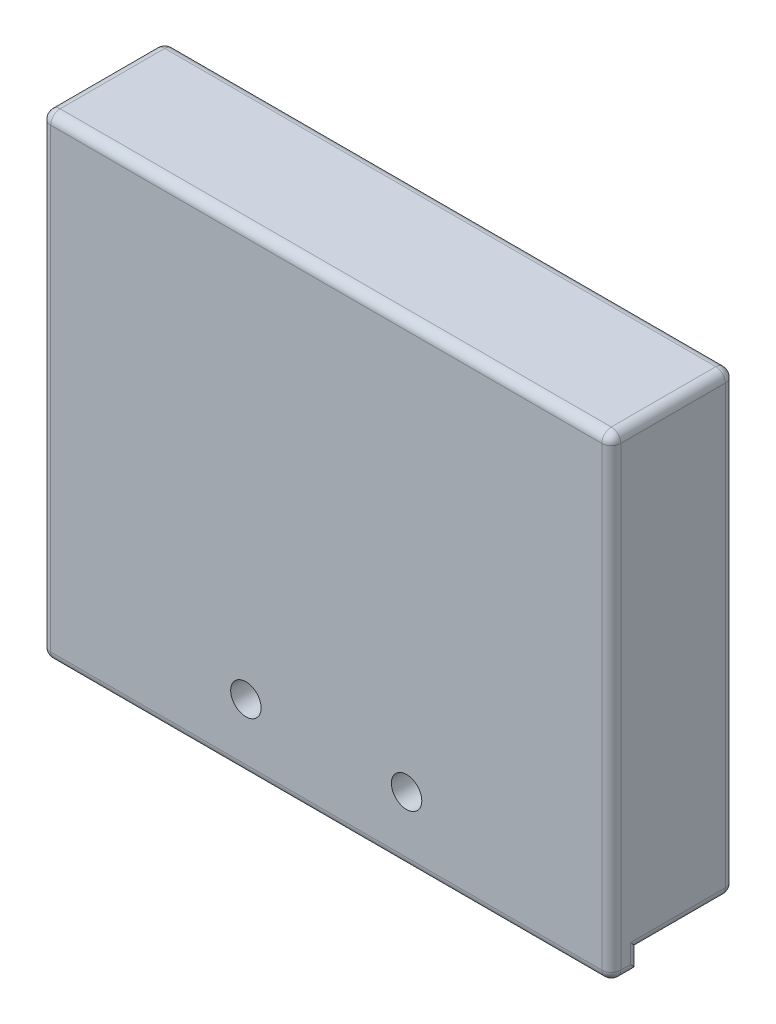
ISO-10303-21;
HEADER;
FILE_DESCRIPTION(('STEP AP214'),'2;1');
FILE_NAME('part.step','',(''),(''),'','','');
FILE_SCHEMA(('AUTOMOTIVE_DESIGN { 1 0 10303 214 1 1 1 1 }'));
ENDSEC;
DATA;
#1=APPLICATION_CONTEXT('core data for automotive mechanical design processes');
#2=APPLICATION_PROTOCOL_DEFINITION('international standard','automotive_design',2000,#1);
#3=PRODUCT_CONTEXT('',#1,'mechanical');
#4=PRODUCT('Part','Part','',(#3));
#5=PRODUCT_RELATED_PRODUCT_CATEGORY('part','',(#4));
#6=PRODUCT_DEFINITION_FORMATION('','',#4);
#7=PRODUCT_DEFINITION_CONTEXT('part definition',#1,'design');
#8=PRODUCT_DEFINITION('design','',#6,#7);
#9=PRODUCT_DEFINITION_SHAPE('','',#8);
#10=(LENGTH_UNIT() NAMED_UNIT(*) SI_UNIT(.MILLI.,.METRE.));
#11=(NAMED_UNIT(*) PLANE_ANGLE_UNIT() SI_UNIT($,.RADIAN.));
#12=(NAMED_UNIT(*) SI_UNIT($,.STERADIAN.) SOLID_ANGLE_UNIT());
#13=UNCERTAINTY_MEASURE_WITH_UNIT(LENGTH_MEASURE(1.E-05),#10,'distance_accuracy_value','');
#14=(GEOMETRIC_REPRESENTATION_CONTEXT(3) GLOBAL_UNCERTAINTY_ASSIGNED_CONTEXT((#13)) GLOBAL_UNIT_ASSIGNED_CONTEXT((#10,
#11,#12)) REPRESENTATION_CONTEXT('',''));
#15=CARTESIAN_POINT('',(0.,0.,0.));
#16=DIRECTION('',(0.,0.,1.));
#17=DIRECTION('',(1.,0.,0.));
#18=AXIS2_PLACEMENT_3D('',#15,#16,#17);
#19=CARTESIAN_POINT('',(0.,0.,3.));
#20=DIRECTION('',(0.,0.,-1.));
#21=DIRECTION('',(-1.,0.,0.));
#22=AXIS2_PLACEMENT_3D('',#19,#20,#21);
#23=PLANE('',#22);
#24=DIRECTION('',(-1.,0.,0.));
#25=VECTOR('',#24,1.);
#26=CARTESIAN_POINT('',(0.,24.,3.));
#27=LINE('',#26,#25);
#28=CARTESIAN_POINT('',(29.,24.,3.));
#29=VERTEX_POINT('',#28);
#30=CARTESIAN_POINT('',(-29.,24.,3.));
#31=VERTEX_POINT('',#30);
#32=EDGE_CURVE('E379',#29,#31,#27,.T.);
#33=ORIENTED_EDGE('',*,*,#32,.T.);
#34=DIRECTION('',(0.,-1.,0.));
#35=VECTOR('',#34,1.);
#36=CARTESIAN_POINT('',(-29.,0.,3.));
#37=LINE('',#36,#35);
#38=CARTESIAN_POINT('',(-29.,-24.,3.));
#39=VERTEX_POINT('',#38);
#40=EDGE_CURVE('E387',#31,#39,#37,.T.);
#41=ORIENTED_EDGE('',*,*,#40,.T.);
#42=DIRECTION('',(1.,0.,0.));
#43=VECTOR('',#42,1.);
#44=CARTESIAN_POINT('',(0.,-24.,3.));
#45=LINE('',#44,#43);
#46=CARTESIAN_POINT('',(29.,-24.,3.));
#47=VERTEX_POINT('',#46);
#48=EDGE_CURVE('E383',#39,#47,#45,.T.);
#49=ORIENTED_EDGE('',*,*,#48,.T.);
#50=DIRECTION('',(0.,1.,0.));
#51=VECTOR('',#50,1.);
#52=CARTESIAN_POINT('',(29.,0.,3.));
#53=LINE('',#52,#51);
#54=EDGE_CURVE('E375',#47,#29,#53,.T.);
#55=ORIENTED_EDGE('',*,*,#54,.T.);
#56=EDGE_LOOP('',(#33,#41,#49,#55));
#57=FACE_BOUND('',#56,.T.);
#58=CARTESIAN_POINT('',(-8.455,-18.04,3.));
#59=DIRECTION('',(0.,0.,1.));
#60=DIRECTION('',(1.,0.,0.));
#61=AXIS2_PLACEMENT_3D('',#58,#59,#60);
#62=CIRCLE('',#61,1.6);
#63=CARTESIAN_POINT('',(-6.855,-18.04,3.));
#64=VERTEX_POINT('',#63);
#65=EDGE_CURVE('E364',#64,#64,#62,.T.);
#66=ORIENTED_EDGE('',*,*,#65,.F.);
#67=EDGE_LOOP('',(#66));
#68=FACE_BOUND('',#67,.T.);
#69=CARTESIAN_POINT('',(8.455,-18.04,3.));
#70=DIRECTION('',(0.,0.,1.));
#71=DIRECTION('',(1.,0.,0.));
#72=AXIS2_PLACEMENT_3D('',#69,#70,#71);
#73=CIRCLE('',#72,1.6);
#74=CARTESIAN_POINT('',(10.055,-18.04,3.));
#75=VERTEX_POINT('',#74);
#76=EDGE_CURVE('E356',#75,#75,#73,.T.);
#77=ORIENTED_EDGE('',*,*,#76,.F.);
#78=EDGE_LOOP('',(#77));
#79=FACE_BOUND('',#78,.T.);
#80=ADVANCED_FACE('F47',(#57,#68,#79),#23,.F.);
#81=CARTESIAN_POINT('',(0.,0.,0.));
#82=DIRECTION('',(0.,0.,-1.));
#83=DIRECTION('',(-1.,0.,0.));
#84=AXIS2_PLACEMENT_3D('',#81,#82,#83);
#85=PLANE('',#84);
#86=DIRECTION('',(1.,0.,0.));
#87=VECTOR('',#86,1.);
#88=CARTESIAN_POINT('',(-30.,-25.,0.));
#89=LINE('',#88,#87);
#90=CARTESIAN_POINT('',(-29.,-25.,0.));
#91=VERTEX_POINT('',#90);
#92=CARTESIAN_POINT('',(29.,-25.,0.));
#93=VERTEX_POINT('',#92);
#94=EDGE_CURVE('E368',#91,#93,#89,.T.);
#95=ORIENTED_EDGE('',*,*,#94,.F.);
#96=DIRECTION('',(0.,-1.,0.));
#97=VECTOR('',#96,1.);
#98=CARTESIAN_POINT('',(-29.,-23.,0.));
#99=LINE('',#98,#97);
#100=CARTESIAN_POINT('',(-29.,-23.,0.));
#101=VERTEX_POINT('',#100);
#102=EDGE_CURVE('E469',#91,#101,#99,.F.);
#103=ORIENTED_EDGE('',*,*,#102,.T.);
#104=DIRECTION('',(-1.,0.,0.));
#105=VECTOR('',#104,1.);
#106=CARTESIAN_POINT('',(-28.,-23.,0.));
#107=LINE('',#106,#105);
#108=CARTESIAN_POINT('',(-28.,-23.,0.));
#109=VERTEX_POINT('',#108);
#110=EDGE_CURVE('E339',#109,#101,#107,.T.);
#111=ORIENTED_EDGE('',*,*,#110,.F.);
#112=DIRECTION('',(0.,-1.,0.));
#113=VECTOR('',#112,1.);
#114=CARTESIAN_POINT('',(-28.,-23.,0.));
#115=LINE('',#114,#113);
#116=CARTESIAN_POINT('',(-28.,23.,0.));
#117=VERTEX_POINT('',#116);
#118=EDGE_CURVE('E335',#117,#109,#115,.T.);
#119=ORIENTED_EDGE('',*,*,#118,.F.);
#120=DIRECTION('',(-1.,0.,0.));
#121=VECTOR('',#120,1.);
#122=CARTESIAN_POINT('',(-28.,23.,0.));
#123=LINE('',#122,#121);
#124=CARTESIAN_POINT('',(28.,23.,0.));
#125=VERTEX_POINT('',#124);
#126=EDGE_CURVE('E329',#125,#117,#123,.T.);
#127=ORIENTED_EDGE('',*,*,#126,.F.);
#128=DIRECTION('',(0.,1.,0.));
#129=VECTOR('',#128,1.);
#130=CARTESIAN_POINT('',(28.,23.,0.));
#131=LINE('',#130,#129);
#132=CARTESIAN_POINT('',(28.,-23.,0.));
#133=VERTEX_POINT('',#132);
#134=EDGE_CURVE('E325',#133,#125,#131,.T.);
#135=ORIENTED_EDGE('',*,*,#134,.F.);
#136=DIRECTION('',(-1.,0.,0.));
#137=VECTOR('',#136,1.);
#138=CARTESIAN_POINT('',(28.,-23.,0.));
#139=LINE('',#138,#137);
#140=CARTESIAN_POINT('',(29.,-23.,0.));
#141=VERTEX_POINT('',#140);
#142=EDGE_CURVE('E98',#141,#133,#139,.T.);
#143=ORIENTED_EDGE('',*,*,#142,.F.);
#144=DIRECTION('',(0.,1.,0.));
#145=VECTOR('',#144,1.);
#146=CARTESIAN_POINT('',(29.,-25.,0.));
#147=LINE('',#146,#145);
#148=EDGE_CURVE('E466',#141,#93,#147,.F.);
#149=ORIENTED_EDGE('',*,*,#148,.T.);
#150=EDGE_LOOP('',(#95,#103,#111,#119,#127,#135,#143,#149));
#151=FACE_BOUND('',#150,.T.);
#152=CARTESIAN_POINT('',(-8.455,-18.04,0.));
#153=DIRECTION('',(0.,0.,1.));
#154=DIRECTION('',(1.,0.,0.));
#155=AXIS2_PLACEMENT_3D('',#152,#153,#154);
#156=CIRCLE('',#155,1.6);
#157=CARTESIAN_POINT('',(-6.855,-18.04,0.));
#158=VERTEX_POINT('',#157);
#159=EDGE_CURVE('E360',#158,#158,#156,.T.);
#160=ORIENTED_EDGE('',*,*,#159,.T.);
#161=EDGE_LOOP('',(#160));
#162=FACE_BOUND('',#161,.T.);
#163=CARTESIAN_POINT('',(8.455,-18.04,0.));
#164=DIRECTION('',(0.,0.,1.));
#165=DIRECTION('',(1.,0.,0.));
#166=AXIS2_PLACEMENT_3D('',#163,#164,#165);
#167=CIRCLE('',#166,1.6);
#168=CARTESIAN_POINT('',(10.055,-18.04,0.));
#169=VERTEX_POINT('',#168);
#170=EDGE_CURVE('E355',#169,#169,#167,.T.);
#171=ORIENTED_EDGE('',*,*,#170,.T.);
#172=EDGE_LOOP('',(#171));
#173=FACE_BOUND('',#172,.T.);
#174=ADVANCED_FACE('F532',(#151,#162,#173),#85,.T.);
#175=CARTESIAN_POINT('',(30.,-25.,3.));
#176=DIRECTION('',(-1.,0.,0.));
#177=DIRECTION('',(0.,0.,1.));
#178=AXIS2_PLACEMENT_3D('',#175,#176,#177);
#179=PLANE('',#178);
#180=DIRECTION('',(0.,1.,0.));
#181=VECTOR('',#180,1.);
#182=CARTESIAN_POINT('',(30.,-25.,2.));
#183=LINE('',#182,#181);
#184=CARTESIAN_POINT('',(30.,24.,2.));
#185=VERTEX_POINT('',#184);
#186=CARTESIAN_POINT('',(30.,-24.,2.));
#187=VERTEX_POINT('',#186);
#188=EDGE_CURVE('E403',#185,#187,#183,.F.);
#189=ORIENTED_EDGE('',*,*,#188,.T.);
#190=DIRECTION('',(0.,0.,-1.));
#191=VECTOR('',#190,1.);
#192=CARTESIAN_POINT('',(30.,-24.,3.));
#193=LINE('',#192,#191);
#194=CARTESIAN_POINT('',(30.,-24.,1.));
#195=VERTEX_POINT('',#194);
#196=EDGE_CURVE('E11',#187,#195,#193,.T.);
#197=ORIENTED_EDGE('',*,*,#196,.T.);
#198=DIRECTION('',(0.,1.,0.));
#199=VECTOR('',#198,1.);
#200=CARTESIAN_POINT('',(30.,-23.,1.));
#201=LINE('',#200,#199);
#202=CARTESIAN_POINT('',(30.,-22.,1.));
#203=VERTEX_POINT('',#202);
#204=EDGE_CURVE('E58',#195,#203,#201,.T.);
#205=ORIENTED_EDGE('',*,*,#204,.T.);
#206=DIRECTION('',(0.,0.,1.));
#207=VECTOR('',#206,1.);
#208=CARTESIAN_POINT('',(30.,-22.,3.));
#209=LINE('',#208,#207);
#210=CARTESIAN_POINT('',(30.,-22.,-9.));
#211=VERTEX_POINT('',#210);
#212=EDGE_CURVE('E196',#203,#211,#209,.F.);
#213=ORIENTED_EDGE('',*,*,#212,.T.);
#214=DIRECTION('',(0.,-1.,0.));
#215=VECTOR('',#214,1.);
#216=CARTESIAN_POINT('',(30.,25.,-9.));
#217=LINE('',#216,#215);
#218=CARTESIAN_POINT('',(30.,24.,-9.));
#219=VERTEX_POINT('',#218);
#220=EDGE_CURVE('E200',#211,#219,#217,.F.);
#221=ORIENTED_EDGE('',*,*,#220,.T.);
#222=DIRECTION('',(0.,0.,-1.));
#223=VECTOR('',#222,1.);
#224=CARTESIAN_POINT('',(30.,24.,3.));
#225=LINE('',#224,#223);
#226=EDGE_CURVE('E225',#219,#185,#225,.F.);
#227=ORIENTED_EDGE('',*,*,#226,.T.);
#228=EDGE_LOOP('',(#189,#197,#205,#213,#221,#227));
#229=FACE_BOUND('',#228,.T.);
#230=ADVANCED_FACE('F198',(#229),#179,.F.);
#231=CARTESIAN_POINT('',(-30.,25.,3.));
#232=DIRECTION('',(0.,-1.,0.));
#233=DIRECTION('',(0.,0.,-1.));
#234=AXIS2_PLACEMENT_3D('',#231,#232,#233);
#235=PLANE('',#234);
#236=DIRECTION('',(1.,0.,0.));
#237=VECTOR('',#236,1.);
#238=CARTESIAN_POINT('',(-30.,25.,-9.));
#239=LINE('',#238,#237);
#240=CARTESIAN_POINT('',(29.,25.,-9.));
#241=VERTEX_POINT('',#240);
#242=CARTESIAN_POINT('',(-29.,25.,-9.));
#243=VERTEX_POINT('',#242);
#244=EDGE_CURVE('E481',#241,#243,#239,.F.);
#245=ORIENTED_EDGE('',*,*,#244,.T.);
#246=DIRECTION('',(0.,0.,-1.));
#247=VECTOR('',#246,1.);
#248=CARTESIAN_POINT('',(-29.,25.,3.));
#249=LINE('',#248,#247);
#250=CARTESIAN_POINT('',(-29.,25.,2.));
#251=VERTEX_POINT('',#250);
#252=EDGE_CURVE('E228',#243,#251,#249,.F.);
#253=ORIENTED_EDGE('',*,*,#252,.T.);
#254=DIRECTION('',(-1.,0.,0.));
#255=VECTOR('',#254,1.);
#256=CARTESIAN_POINT('',(-30.,25.,2.));
#257=LINE('',#256,#255);
#258=CARTESIAN_POINT('',(29.,25.,2.));
#259=VERTEX_POINT('',#258);
#260=EDGE_CURVE('E399',#251,#259,#257,.F.);
#261=ORIENTED_EDGE('',*,*,#260,.T.);
#262=DIRECTION('',(0.,0.,-1.));
#263=VECTOR('',#262,1.);
#264=CARTESIAN_POINT('',(29.,25.,3.));
#265=LINE('',#264,#263);
#266=EDGE_CURVE('E478',#259,#241,#265,.T.);
#267=ORIENTED_EDGE('',*,*,#266,.T.);
#268=EDGE_LOOP('',(#245,#253,#261,#267));
#269=FACE_BOUND('',#268,.T.);
#270=ADVANCED_FACE('F487',(#269),#235,.F.);
#271=CARTESIAN_POINT('',(-30.,-25.,3.));
#272=DIRECTION('',(1.,0.,0.));
#273=DIRECTION('',(0.,0.,-1.));
#274=AXIS2_PLACEMENT_3D('',#271,#272,#273);
#275=PLANE('',#274);
#276=DIRECTION('',(0.,-1.,0.));
#277=VECTOR('',#276,1.);
#278=CARTESIAN_POINT('',(-30.,-25.,1.));
#279=LINE('',#278,#277);
#280=CARTESIAN_POINT('',(-30.,-22.,1.));
#281=VERTEX_POINT('',#280);
#282=CARTESIAN_POINT('',(-30.,-24.,1.));
#283=VERTEX_POINT('',#282);
#284=EDGE_CURVE('E460',#281,#283,#279,.T.);
#285=ORIENTED_EDGE('',*,*,#284,.T.);
#286=DIRECTION('',(0.,0.,-1.));
#287=VECTOR('',#286,1.);
#288=CARTESIAN_POINT('',(-30.,-24.,3.));
#289=LINE('',#288,#287);
#290=CARTESIAN_POINT('',(-30.,-24.,2.));
#291=VERTEX_POINT('',#290);
#292=EDGE_CURVE('E463',#283,#291,#289,.F.);
#293=ORIENTED_EDGE('',*,*,#292,.T.);
#294=DIRECTION('',(0.,-1.,0.));
#295=VECTOR('',#294,1.);
#296=CARTESIAN_POINT('',(-30.,-25.,2.));
#297=LINE('',#296,#295);
#298=CARTESIAN_POINT('',(-30.,24.,2.));
#299=VERTEX_POINT('',#298);
#300=EDGE_CURVE('E391',#291,#299,#297,.F.);
#301=ORIENTED_EDGE('',*,*,#300,.T.);
#302=DIRECTION('',(0.,0.,-1.));
#303=VECTOR('',#302,1.);
#304=CARTESIAN_POINT('',(-30.,24.,3.));
#305=LINE('',#304,#303);
#306=CARTESIAN_POINT('',(-30.,24.,-9.));
#307=VERTEX_POINT('',#306);
#308=EDGE_CURVE('E451',#299,#307,#305,.T.);
#309=ORIENTED_EDGE('',*,*,#308,.T.);
#310=DIRECTION('',(0.,1.,0.));
#311=VECTOR('',#310,1.);
#312=CARTESIAN_POINT('',(-30.,-23.,-9.));
#313=LINE('',#312,#311);
#314=CARTESIAN_POINT('',(-30.,-22.,-9.));
#315=VERTEX_POINT('',#314);
#316=EDGE_CURVE('E454',#307,#315,#313,.F.);
#317=ORIENTED_EDGE('',*,*,#316,.T.);
#318=DIRECTION('',(0.,0.,1.));
#319=VECTOR('',#318,1.);
#320=CARTESIAN_POINT('',(-30.,-22.,3.));
#321=LINE('',#320,#319);
#322=EDGE_CURVE('E457',#315,#281,#321,.T.);
#323=ORIENTED_EDGE('',*,*,#322,.T.);
#324=EDGE_LOOP('',(#285,#293,#301,#309,#317,#323));
#325=FACE_BOUND('',#324,.T.);
#326=ADVANCED_FACE('F506',(#325),#275,.F.);
#327=CARTESIAN_POINT('',(-30.,-25.,3.));
#328=DIRECTION('',(0.,1.,0.));
#329=DIRECTION('',(0.,0.,1.));
#330=AXIS2_PLACEMENT_3D('',#327,#328,#329);
#331=PLANE('',#330);
#332=DIRECTION('',(1.,0.,0.));
#333=VECTOR('',#332,1.);
#334=CARTESIAN_POINT('',(-30.,-25.,2.));
#335=LINE('',#334,#333);
#336=CARTESIAN_POINT('',(29.,-25.,2.));
#337=VERTEX_POINT('',#336);
#338=CARTESIAN_POINT('',(-29.,-25.,2.));
#339=VERTEX_POINT('',#338);
#340=EDGE_CURVE('E395',#337,#339,#335,.F.);
#341=ORIENTED_EDGE('',*,*,#340,.T.);
#342=DIRECTION('',(0.,0.,-1.));
#343=VECTOR('',#342,1.);
#344=CARTESIAN_POINT('',(-29.,-25.,3.));
#345=LINE('',#344,#343);
#346=EDGE_CURVE('E475',#339,#91,#345,.T.);
#347=ORIENTED_EDGE('',*,*,#346,.T.);
#348=ORIENTED_EDGE('',*,*,#94,.T.);
#349=DIRECTION('',(0.,0.,-1.));
#350=VECTOR('',#349,1.);
#351=CARTESIAN_POINT('',(29.,-25.,3.));
#352=LINE('',#351,#350);
#353=EDGE_CURVE('E472',#93,#337,#352,.F.);
#354=ORIENTED_EDGE('',*,*,#353,.T.);
#355=EDGE_LOOP('',(#341,#347,#348,#354));
#356=FACE_BOUND('',#355,.T.);
#357=ADVANCED_FACE('F527',(#356),#331,.F.);
#358=CARTESIAN_POINT('',(-8.455,-18.04,3.));
#359=DIRECTION('',(0.,0.,-1.));
#360=DIRECTION('',(-1.,0.,0.));
#361=AXIS2_PLACEMENT_3D('',#358,#359,#360);
#362=CYLINDRICAL_SURFACE('',#361,1.6);
#363=ORIENTED_EDGE('',*,*,#65,.T.);
#364=EDGE_LOOP('',(#363));
#365=FACE_BOUND('',#364,.T.);
#366=ORIENTED_EDGE('',*,*,#159,.F.);
#367=EDGE_LOOP('',(#366));
#368=FACE_BOUND('',#367,.T.);
#369=ADVANCED_FACE('F589',(#365,#368),#362,.F.);
#370=CARTESIAN_POINT('',(8.455,-18.04,3.));
#371=DIRECTION('',(0.,0.,-1.));
#372=DIRECTION('',(-1.,0.,0.));
#373=AXIS2_PLACEMENT_3D('',#370,#371,#372);
#374=CYLINDRICAL_SURFACE('',#373,1.6);
#375=ORIENTED_EDGE('',*,*,#76,.T.);
#376=EDGE_LOOP('',(#375));
#377=FACE_BOUND('',#376,.T.);
#378=ORIENTED_EDGE('',*,*,#170,.F.);
#379=EDGE_LOOP('',(#378));
#380=FACE_BOUND('',#379,.T.);
#381=ADVANCED_FACE('F866',(#377,#380),#374,.F.);
#382=CARTESIAN_POINT('',(28.,-23.,-10.));
#383=DIRECTION('',(0.,1.,0.));
#384=DIRECTION('',(0.,0.,1.));
#385=AXIS2_PLACEMENT_3D('',#382,#383,#384);
#386=PLANE('',#385);
#387=DIRECTION('',(0.,0.,1.));
#388=VECTOR('',#387,1.);
#389=CARTESIAN_POINT('',(28.,-23.,-10.));
#390=LINE('',#389,#388);
#391=CARTESIAN_POINT('',(28.,-23.,-9.));
#392=VERTEX_POINT('',#391);
#393=EDGE_CURVE('E352',#392,#133,#390,.T.);
#394=ORIENTED_EDGE('',*,*,#393,.F.);
#395=DIRECTION('',(-1.,0.,0.));
#396=VECTOR('',#395,1.);
#397=CARTESIAN_POINT('',(30.,-23.,-9.));
#398=LINE('',#397,#396);
#399=CARTESIAN_POINT('',(29.,-23.,-9.));
#400=VERTEX_POINT('',#399);
#401=EDGE_CURVE('E448',#392,#400,#398,.F.);
#402=ORIENTED_EDGE('',*,*,#401,.T.);
#403=DIRECTION('',(0.,0.,1.));
#404=VECTOR('',#403,1.);
#405=CARTESIAN_POINT('',(29.,-23.,-10.));
#406=LINE('',#405,#404);
#407=EDGE_CURVE('E211',#400,#141,#406,.T.);
#408=ORIENTED_EDGE('',*,*,#407,.T.);
#409=ORIENTED_EDGE('',*,*,#142,.T.);
#410=EDGE_LOOP('',(#394,#402,#408,#409));
#411=FACE_BOUND('',#410,.T.);
#412=ADVANCED_FACE('F543',(#411),#386,.F.);
#413=CARTESIAN_POINT('',(28.,23.,-10.));
#414=DIRECTION('',(1.,0.,0.));
#415=DIRECTION('',(0.,1.,0.));
#416=AXIS2_PLACEMENT_3D('',#413,#414,#415);
#417=PLANE('',#416);
#418=DIRECTION('',(0.,0.,1.));
#419=VECTOR('',#418,1.);
#420=CARTESIAN_POINT('',(28.,23.,-10.));
#421=LINE('',#420,#419);
#422=CARTESIAN_POINT('',(28.,23.,-9.));
#423=VERTEX_POINT('',#422);
#424=EDGE_CURVE('E349',#423,#125,#421,.T.);
#425=ORIENTED_EDGE('',*,*,#424,.F.);
#426=DIRECTION('',(0.,1.,0.));
#427=VECTOR('',#426,1.);
#428=CARTESIAN_POINT('',(28.,-23.,-9.));
#429=LINE('',#428,#427);
#430=EDGE_CURVE('E443',#423,#392,#429,.F.);
#431=ORIENTED_EDGE('',*,*,#430,.T.);
#432=ORIENTED_EDGE('',*,*,#393,.T.);
#433=ORIENTED_EDGE('',*,*,#134,.T.);
#434=EDGE_LOOP('',(#425,#431,#432,#433));
#435=FACE_BOUND('',#434,.T.);
#436=ADVANCED_FACE('F540',(#435),#417,.F.);
#437=CARTESIAN_POINT('',(-28.,23.,-10.));
#438=DIRECTION('',(0.,1.,0.));
#439=DIRECTION('',(0.,0.,1.));
#440=AXIS2_PLACEMENT_3D('',#437,#438,#439);
#441=PLANE('',#440);
#442=DIRECTION('',(0.,0.,1.));
#443=VECTOR('',#442,1.);
#444=CARTESIAN_POINT('',(-28.,23.,-10.));
#445=LINE('',#444,#443);
#446=CARTESIAN_POINT('',(-28.,23.,-9.));
#447=VERTEX_POINT('',#446);
#448=EDGE_CURVE('E346',#447,#117,#445,.T.);
#449=ORIENTED_EDGE('',*,*,#448,.F.);
#450=DIRECTION('',(-1.,0.,0.));
#451=VECTOR('',#450,1.);
#452=CARTESIAN_POINT('',(28.,23.,-9.));
#453=LINE('',#452,#451);
#454=EDGE_CURVE('E440',#447,#423,#453,.F.);
#455=ORIENTED_EDGE('',*,*,#454,.T.);
#456=ORIENTED_EDGE('',*,*,#424,.T.);
#457=ORIENTED_EDGE('',*,*,#126,.T.);
#458=EDGE_LOOP('',(#449,#455,#456,#457));
#459=FACE_BOUND('',#458,.T.);
#460=ADVANCED_FACE('F842',(#459),#441,.F.);
#461=CARTESIAN_POINT('',(-28.,-23.,-10.));
#462=DIRECTION('',(-1.,0.,0.));
#463=DIRECTION('',(0.,0.,1.));
#464=AXIS2_PLACEMENT_3D('',#461,#462,#463);
#465=PLANE('',#464);
#466=DIRECTION('',(0.,0.,1.));
#467=VECTOR('',#466,1.);
#468=CARTESIAN_POINT('',(-28.,-23.,-10.));
#469=LINE('',#468,#467);
#470=CARTESIAN_POINT('',(-28.,-23.,-9.));
#471=VERTEX_POINT('',#470);
#472=EDGE_CURVE('E343',#471,#109,#469,.T.);
#473=ORIENTED_EDGE('',*,*,#472,.F.);
#474=DIRECTION('',(0.,-1.,0.));
#475=VECTOR('',#474,1.);
#476=CARTESIAN_POINT('',(-28.,23.,-9.));
#477=LINE('',#476,#475);
#478=EDGE_CURVE('E437',#471,#447,#477,.F.);
#479=ORIENTED_EDGE('',*,*,#478,.T.);
#480=ORIENTED_EDGE('',*,*,#448,.T.);
#481=ORIENTED_EDGE('',*,*,#118,.T.);
#482=EDGE_LOOP('',(#473,#479,#480,#481));
#483=FACE_BOUND('',#482,.T.);
#484=ADVANCED_FACE('F833',(#483),#465,.F.);
#485=CARTESIAN_POINT('',(-28.,-23.,-10.));
#486=DIRECTION('',(0.,1.,0.));
#487=DIRECTION('',(0.,0.,1.));
#488=AXIS2_PLACEMENT_3D('',#485,#486,#487);
#489=PLANE('',#488);
#490=DIRECTION('',(0.,0.,1.));
#491=VECTOR('',#490,1.);
#492=CARTESIAN_POINT('',(-29.,-23.,-10.));
#493=LINE('',#492,#491);
#494=CARTESIAN_POINT('',(-29.,-23.,-9.));
#495=VERTEX_POINT('',#494);
#496=EDGE_CURVE('E431',#101,#495,#493,.F.);
#497=ORIENTED_EDGE('',*,*,#496,.T.);
#498=DIRECTION('',(-1.,0.,0.));
#499=VECTOR('',#498,1.);
#500=CARTESIAN_POINT('',(-28.,-23.,-9.));
#501=LINE('',#500,#499);
#502=EDGE_CURVE('E434',#495,#471,#501,.F.);
#503=ORIENTED_EDGE('',*,*,#502,.T.);
#504=ORIENTED_EDGE('',*,*,#472,.T.);
#505=ORIENTED_EDGE('',*,*,#110,.T.);
#506=EDGE_LOOP('',(#497,#503,#504,#505));
#507=FACE_BOUND('',#506,.T.);
#508=ADVANCED_FACE('F608',(#507),#489,.F.);
#509=CARTESIAN_POINT('',(29.,0.,2.));
#510=DIRECTION('',(0.,1.,0.));
#511=DIRECTION('',(0.,0.,1.));
#512=AXIS2_PLACEMENT_3D('',#509,#510,#511);
#513=CYLINDRICAL_SURFACE('',#512,1.);
#514=ORIENTED_EDGE('',*,*,#54,.F.);
#515=CARTESIAN_POINT('',(29.,-24.,2.));
#516=DIRECTION('',(0.,1.,0.));
#517=DIRECTION('',(0.,0.,1.));
#518=AXIS2_PLACEMENT_3D('',#515,#516,#517);
#519=CIRCLE('',#518,1.);
#520=EDGE_CURVE('E428',#47,#187,#519,.T.);
#521=ORIENTED_EDGE('',*,*,#520,.T.);
#522=ORIENTED_EDGE('',*,*,#188,.F.);
#523=CARTESIAN_POINT('',(29.,24.,2.));
#524=DIRECTION('',(0.,1.,0.));
#525=DIRECTION('',(0.,0.,1.));
#526=AXIS2_PLACEMENT_3D('',#523,#524,#525);
#527=CIRCLE('',#526,1.);
#528=EDGE_CURVE('E425',#185,#29,#527,.F.);
#529=ORIENTED_EDGE('',*,*,#528,.T.);
#530=EDGE_LOOP('',(#514,#521,#522,#529));
#531=FACE_BOUND('',#530,.T.);
#532=ADVANCED_FACE('F567',(#531),#513,.T.);
#533=CARTESIAN_POINT('',(0.,24.,2.));
#534=DIRECTION('',(-1.,0.,0.));
#535=DIRECTION('',(0.,0.,1.));
#536=AXIS2_PLACEMENT_3D('',#533,#534,#535);
#537=CYLINDRICAL_SURFACE('',#536,1.);
#538=ORIENTED_EDGE('',*,*,#260,.F.);
#539=CARTESIAN_POINT('',(-29.,24.,2.));
#540=DIRECTION('',(-1.,0.,0.));
#541=DIRECTION('',(0.,0.,1.));
#542=AXIS2_PLACEMENT_3D('',#539,#540,#541);
#543=CIRCLE('',#542,1.);
#544=EDGE_CURVE('E422',#251,#31,#543,.F.);
#545=ORIENTED_EDGE('',*,*,#544,.T.);
#546=ORIENTED_EDGE('',*,*,#32,.F.);
#547=CARTESIAN_POINT('',(29.,24.,2.));
#548=DIRECTION('',(-1.,0.,0.));
#549=DIRECTION('',(0.,0.,1.));
#550=AXIS2_PLACEMENT_3D('',#547,#548,#549);
#551=CIRCLE('',#550,1.);
#552=EDGE_CURVE('E419',#29,#259,#551,.T.);
#553=ORIENTED_EDGE('',*,*,#552,.T.);
#554=EDGE_LOOP('',(#538,#545,#546,#553));
#555=FACE_BOUND('',#554,.T.);
#556=ADVANCED_FACE('F495',(#555),#537,.T.);
#557=CARTESIAN_POINT('',(0.,-24.,2.));
#558=DIRECTION('',(1.,0.,0.));
#559=DIRECTION('',(0.,0.,-1.));
#560=AXIS2_PLACEMENT_3D('',#557,#558,#559);
#561=CYLINDRICAL_SURFACE('',#560,1.);
#562=ORIENTED_EDGE('',*,*,#48,.F.);
#563=CARTESIAN_POINT('',(-29.,-24.,2.));
#564=DIRECTION('',(1.,0.,0.));
#565=DIRECTION('',(0.,0.,-1.));
#566=AXIS2_PLACEMENT_3D('',#563,#564,#565);
#567=CIRCLE('',#566,1.);
#568=EDGE_CURVE('E416',#39,#339,#567,.T.);
#569=ORIENTED_EDGE('',*,*,#568,.T.);
#570=ORIENTED_EDGE('',*,*,#340,.F.);
#571=CARTESIAN_POINT('',(29.,-24.,2.));
#572=DIRECTION('',(1.,0.,0.));
#573=DIRECTION('',(0.,0.,-1.));
#574=AXIS2_PLACEMENT_3D('',#571,#572,#573);
#575=CIRCLE('',#574,1.);
#576=EDGE_CURVE('E413',#337,#47,#575,.F.);
#577=ORIENTED_EDGE('',*,*,#576,.T.);
#578=EDGE_LOOP('',(#562,#569,#570,#577));
#579=FACE_BOUND('',#578,.T.);
#580=ADVANCED_FACE('F524',(#579),#561,.T.);
#581=CARTESIAN_POINT('',(-29.,0.,2.));
#582=DIRECTION('',(0.,-1.,0.));
#583=DIRECTION('',(0.,0.,-1.));
#584=AXIS2_PLACEMENT_3D('',#581,#582,#583);
#585=CYLINDRICAL_SURFACE('',#584,1.);
#586=ORIENTED_EDGE('',*,*,#300,.F.);
#587=CARTESIAN_POINT('',(-29.,-24.,2.));
#588=DIRECTION('',(0.,-1.,0.));
#589=DIRECTION('',(0.,0.,-1.));
#590=AXIS2_PLACEMENT_3D('',#587,#588,#589);
#591=CIRCLE('',#590,1.);
#592=EDGE_CURVE('E409',#291,#39,#591,.F.);
#593=ORIENTED_EDGE('',*,*,#592,.T.);
#594=ORIENTED_EDGE('',*,*,#40,.F.);
#595=CARTESIAN_POINT('',(-29.,24.,2.));
#596=DIRECTION('',(0.,-1.,0.));
#597=DIRECTION('',(0.,0.,-1.));
#598=AXIS2_PLACEMENT_3D('',#595,#596,#597);
#599=CIRCLE('',#598,1.);
#600=EDGE_CURVE('E406',#31,#299,#599,.T.);
#601=ORIENTED_EDGE('',*,*,#600,.T.);
#602=EDGE_LOOP('',(#586,#593,#594,#601));
#603=FACE_BOUND('',#602,.T.);
#604=ADVANCED_FACE('F513',(#603),#585,.T.);
#605=CARTESIAN_POINT('',(29.,-24.,2.));
#606=DIRECTION('',(0.,0.,1.));
#607=DIRECTION('',(1.,0.,0.));
#608=AXIS2_PLACEMENT_3D('',#605,#606,#607);
#609=SPHERICAL_SURFACE('',#608,1.);
#610=ORIENTED_EDGE('',*,*,#520,.F.);
#611=ORIENTED_EDGE('',*,*,#576,.F.);
#612=CARTESIAN_POINT('',(29.,-24.,2.));
#613=DIRECTION('',(0.,0.,-1.));
#614=DIRECTION('',(-1.,0.,0.));
#615=AXIS2_PLACEMENT_3D('',#612,#613,#614);
#616=CIRCLE('',#615,1.);
#617=EDGE_CURVE('E51',#187,#337,#616,.T.);
#618=ORIENTED_EDGE('',*,*,#617,.F.);
#619=EDGE_LOOP('',(#610,#611,#618));
#620=FACE_BOUND('',#619,.T.);
#621=ADVANCED_FACE('F49',(#620),#609,.T.);
#622=CARTESIAN_POINT('',(29.,-24.,3.));
#623=DIRECTION('',(0.,0.,-1.));
#624=DIRECTION('',(-1.,0.,0.));
#625=AXIS2_PLACEMENT_3D('',#622,#623,#624);
#626=CYLINDRICAL_SURFACE('',#625,1.);
#627=ORIENTED_EDGE('',*,*,#617,.T.);
#628=ORIENTED_EDGE('',*,*,#353,.F.);
#629=CARTESIAN_POINT('',(29.,-24.,1.));
#630=DIRECTION('',(0.,0.707106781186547,-0.707106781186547));
#631=DIRECTION('',(0.,-0.707106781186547,-0.707106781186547));
#632=AXIS2_PLACEMENT_3D('',#629,#630,#631);
#633=ELLIPSE('',#632,1.41421356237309,1.);
#634=EDGE_CURVE('E314',#195,#93,#633,.T.);
#635=ORIENTED_EDGE('',*,*,#634,.F.);
#636=ORIENTED_EDGE('',*,*,#196,.F.);
#637=EDGE_LOOP('',(#627,#628,#635,#636));
#638=FACE_BOUND('',#637,.T.);
#639=ADVANCED_FACE('F529',(#638),#626,.T.);
#640=CARTESIAN_POINT('',(29.,-25.,1.));
#641=DIRECTION('',(0.,-1.,0.));
#642=DIRECTION('',(0.,0.,-1.));
#643=AXIS2_PLACEMENT_3D('',#640,#641,#642);
#644=CYLINDRICAL_SURFACE('',#643,1.);
#645=ORIENTED_EDGE('',*,*,#634,.T.);
#646=ORIENTED_EDGE('',*,*,#148,.F.);
#647=CARTESIAN_POINT('',(29.,-22.,1.));
#648=DIRECTION('',(0.,-0.707106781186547,0.707106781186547));
#649=DIRECTION('',(0.,0.707106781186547,0.707106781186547));
#650=AXIS2_PLACEMENT_3D('',#647,#648,#649);
#651=ELLIPSE('',#650,1.41421356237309,1.);
#652=EDGE_CURVE('E213',#203,#141,#651,.F.);
#653=ORIENTED_EDGE('',*,*,#652,.F.);
#654=ORIENTED_EDGE('',*,*,#204,.F.);
#655=EDGE_LOOP('',(#645,#646,#653,#654));
#656=FACE_BOUND('',#655,.T.);
#657=ADVANCED_FACE('F530',(#656),#644,.T.);
#658=CARTESIAN_POINT('',(29.,-22.,-10.));
#659=DIRECTION('',(0.,0.,1.));
#660=DIRECTION('',(1.,0.,0.));
#661=AXIS2_PLACEMENT_3D('',#658,#659,#660);
#662=CYLINDRICAL_SURFACE('',#661,1.);
#663=CARTESIAN_POINT('',(29.,-22.,-9.));
#664=DIRECTION('',(0.,0.,-1.));
#665=DIRECTION('',(-1.,0.,0.));
#666=AXIS2_PLACEMENT_3D('',#663,#664,#665);
#667=CIRCLE('',#666,1.);
#668=EDGE_CURVE('E209',#211,#400,#667,.T.);
#669=ORIENTED_EDGE('',*,*,#668,.F.);
#670=ORIENTED_EDGE('',*,*,#212,.F.);
#671=ORIENTED_EDGE('',*,*,#652,.T.);
#672=ORIENTED_EDGE('',*,*,#407,.F.);
#673=EDGE_LOOP('',(#669,#670,#671,#672));
#674=FACE_BOUND('',#673,.T.);
#675=ADVANCED_FACE('F210',(#674),#662,.T.);
#676=CARTESIAN_POINT('',(29.,-22.,-9.));
#677=DIRECTION('',(0.,-1.,0.));
#678=DIRECTION('',(0.,0.,-1.));
#679=AXIS2_PLACEMENT_3D('',#676,#677,#678);
#680=SPHERICAL_SURFACE('',#679,1.);
#681=CARTESIAN_POINT('',(29.,-22.,-9.));
#682=DIRECTION('',(0.,-1.,0.));
#683=DIRECTION('',(0.,0.,-1.));
#684=AXIS2_PLACEMENT_3D('',#681,#682,#683);
#685=CIRCLE('',#684,1.);
#686=CARTESIAN_POINT('',(29.,-22.,-10.));
#687=VERTEX_POINT('',#686);
#688=EDGE_CURVE('E215',#211,#687,#685,.F.);
#689=ORIENTED_EDGE('',*,*,#688,.F.);
#690=ORIENTED_EDGE('',*,*,#668,.T.);
#691=CARTESIAN_POINT('',(29.,-22.,-9.));
#692=DIRECTION('',(1.,0.,0.));
#693=DIRECTION('',(0.,0.,-1.));
#694=AXIS2_PLACEMENT_3D('',#691,#692,#693);
#695=CIRCLE('',#694,1.);
#696=EDGE_CURVE('E90',#687,#400,#695,.F.);
#697=ORIENTED_EDGE('',*,*,#696,.F.);
#698=EDGE_LOOP('',(#689,#690,#697));
#699=FACE_BOUND('',#698,.T.);
#700=ADVANCED_FACE('F216',(#699),#680,.T.);
#701=CARTESIAN_POINT('',(29.,24.,2.));
#702=DIRECTION('',(0.,0.,1.));
#703=DIRECTION('',(1.,0.,0.));
#704=AXIS2_PLACEMENT_3D('',#701,#702,#703);
#705=SPHERICAL_SURFACE('',#704,1.);
#706=ORIENTED_EDGE('',*,*,#552,.F.);
#707=ORIENTED_EDGE('',*,*,#528,.F.);
#708=CARTESIAN_POINT('',(29.,24.,2.));
#709=DIRECTION('',(0.,0.,-1.));
#710=DIRECTION('',(-1.,0.,0.));
#711=AXIS2_PLACEMENT_3D('',#708,#709,#710);
#712=CIRCLE('',#711,1.);
#713=EDGE_CURVE('E219',#259,#185,#712,.T.);
#714=ORIENTED_EDGE('',*,*,#713,.F.);
#715=EDGE_LOOP('',(#706,#707,#714));
#716=FACE_BOUND('',#715,.T.);
#717=ADVANCED_FACE('F570',(#716),#705,.T.);
#718=CARTESIAN_POINT('',(0.,-22.,-9.));
#719=DIRECTION('',(1.,0.,0.));
#720=DIRECTION('',(0.,0.,-1.));
#721=AXIS2_PLACEMENT_3D('',#718,#719,#720);
#722=CYLINDRICAL_SURFACE('',#721,1.);
#723=ORIENTED_EDGE('',*,*,#696,.T.);
#724=ORIENTED_EDGE('',*,*,#401,.F.);
#725=CARTESIAN_POINT('',(29.,-22.,-9.));
#726=DIRECTION('',(0.707106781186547,-0.707106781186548,0.));
#727=DIRECTION('',(0.707106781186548,0.707106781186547,0.));
#728=AXIS2_PLACEMENT_3D('',#725,#726,#727);
#729=ELLIPSE('',#728,1.4142135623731,1.);
#730=EDGE_CURVE('E304',#687,#392,#729,.F.);
#731=ORIENTED_EDGE('',*,*,#730,.F.);
#732=EDGE_LOOP('',(#723,#724,#731));
#733=FACE_BOUND('',#732,.T.);
#734=ADVANCED_FACE('F545',(#733),#722,.T.);
#735=CARTESIAN_POINT('',(29.,0.,-9.));
#736=DIRECTION('',(0.,1.,0.));
#737=DIRECTION('',(0.,0.,1.));
#738=AXIS2_PLACEMENT_3D('',#735,#736,#737);
#739=CYLINDRICAL_SURFACE('',#738,1.);
#740=ORIENTED_EDGE('',*,*,#220,.F.);
#741=ORIENTED_EDGE('',*,*,#688,.T.);
#742=DIRECTION('',(0.,-1.,0.));
#743=VECTOR('',#742,1.);
#744=CARTESIAN_POINT('',(29.,-23.,-10.));
#745=LINE('',#744,#743);
#746=CARTESIAN_POINT('',(29.,24.,-10.));
#747=VERTEX_POINT('',#746);
#748=EDGE_CURVE('E82',#747,#687,#745,.T.);
#749=ORIENTED_EDGE('',*,*,#748,.F.);
#750=CARTESIAN_POINT('',(29.,24.,-9.));
#751=DIRECTION('',(0.,1.,0.));
#752=DIRECTION('',(0.,0.,1.));
#753=AXIS2_PLACEMENT_3D('',#750,#751,#752);
#754=CIRCLE('',#753,1.);
#755=EDGE_CURVE('E222',#219,#747,#754,.T.);
#756=ORIENTED_EDGE('',*,*,#755,.F.);
#757=EDGE_LOOP('',(#740,#741,#749,#756));
#758=FACE_BOUND('',#757,.T.);
#759=ADVANCED_FACE('F221',(#758),#739,.T.);
#760=CARTESIAN_POINT('',(29.,24.,3.));
#761=DIRECTION('',(0.,0.,-1.));
#762=DIRECTION('',(-1.,0.,0.));
#763=AXIS2_PLACEMENT_3D('',#760,#761,#762);
#764=CYLINDRICAL_SURFACE('',#763,1.);
#765=ORIENTED_EDGE('',*,*,#713,.T.);
#766=ORIENTED_EDGE('',*,*,#226,.F.);
#767=CARTESIAN_POINT('',(29.,24.,-9.));
#768=DIRECTION('',(0.,0.,-1.));
#769=DIRECTION('',(-1.,0.,0.));
#770=AXIS2_PLACEMENT_3D('',#767,#768,#769);
#771=CIRCLE('',#770,1.);
#772=EDGE_CURVE('E297',#241,#219,#771,.T.);
#773=ORIENTED_EDGE('',*,*,#772,.F.);
#774=ORIENTED_EDGE('',*,*,#266,.F.);
#775=EDGE_LOOP('',(#765,#766,#773,#774));
#776=FACE_BOUND('',#775,.T.);
#777=ADVANCED_FACE('F562',(#776),#764,.T.);
#778=CARTESIAN_POINT('',(29.,0.,-9.));
#779=DIRECTION('',(0.,-1.,0.));
#780=DIRECTION('',(1.,0.,0.));
#781=AXIS2_PLACEMENT_3D('',#778,#779,#780);
#782=CYLINDRICAL_SURFACE('',#781,1.);
#783=ORIENTED_EDGE('',*,*,#730,.T.);
#784=ORIENTED_EDGE('',*,*,#430,.F.);
#785=CARTESIAN_POINT('',(29.,24.,-9.));
#786=DIRECTION('',(0.707106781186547,-0.707106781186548,0.));
#787=DIRECTION('',(0.707106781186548,0.707106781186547,0.));
#788=AXIS2_PLACEMENT_3D('',#785,#786,#787);
#789=ELLIPSE('',#788,1.4142135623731,1.);
#790=EDGE_CURVE('E293',#747,#423,#789,.F.);
#791=ORIENTED_EDGE('',*,*,#790,.F.);
#792=ORIENTED_EDGE('',*,*,#748,.T.);
#793=EDGE_LOOP('',(#783,#784,#791,#792));
#794=FACE_BOUND('',#793,.T.);
#795=ADVANCED_FACE('F547',(#794),#782,.T.);
#796=CARTESIAN_POINT('',(29.,24.,-9.));
#797=DIRECTION('',(1.,0.,0.));
#798=DIRECTION('',(0.,0.,-1.));
#799=AXIS2_PLACEMENT_3D('',#796,#797,#798);
#800=SPHERICAL_SURFACE('',#799,1.);
#801=ORIENTED_EDGE('',*,*,#772,.T.);
#802=ORIENTED_EDGE('',*,*,#755,.T.);
#803=CARTESIAN_POINT('',(29.,24.,-9.));
#804=DIRECTION('',(1.,0.,0.));
#805=DIRECTION('',(0.,0.,-1.));
#806=AXIS2_PLACEMENT_3D('',#803,#804,#805);
#807=CIRCLE('',#806,1.);
#808=EDGE_CURVE('E286',#241,#747,#807,.F.);
#809=ORIENTED_EDGE('',*,*,#808,.F.);
#810=EDGE_LOOP('',(#801,#802,#809));
#811=FACE_BOUND('',#810,.T.);
#812=ADVANCED_FACE('F558',(#811),#800,.T.);
#813=CARTESIAN_POINT('',(-29.,24.,2.));
#814=DIRECTION('',(0.,0.,1.));
#815=DIRECTION('',(1.,0.,0.));
#816=AXIS2_PLACEMENT_3D('',#813,#814,#815);
#817=SPHERICAL_SURFACE('',#816,1.);
#818=ORIENTED_EDGE('',*,*,#600,.F.);
#819=ORIENTED_EDGE('',*,*,#544,.F.);
#820=CARTESIAN_POINT('',(-29.,24.,2.));
#821=DIRECTION('',(0.,0.,-1.));
#822=DIRECTION('',(-1.,0.,0.));
#823=AXIS2_PLACEMENT_3D('',#820,#821,#822);
#824=CIRCLE('',#823,1.);
#825=EDGE_CURVE('E282',#299,#251,#824,.T.);
#826=ORIENTED_EDGE('',*,*,#825,.F.);
#827=EDGE_LOOP('',(#818,#819,#826));
#828=FACE_BOUND('',#827,.T.);
#829=ADVANCED_FACE('F501',(#828),#817,.T.);
#830=CARTESIAN_POINT('',(0.,24.,-9.));
#831=DIRECTION('',(1.,0.,0.));
#832=DIRECTION('',(0.,0.,-1.));
#833=AXIS2_PLACEMENT_3D('',#830,#831,#832);
#834=CYLINDRICAL_SURFACE('',#833,1.);
#835=DIRECTION('',(-1.,0.,0.));
#836=VECTOR('',#835,1.);
#837=CARTESIAN_POINT('',(-28.,24.,-10.));
#838=LINE('',#837,#836);
#839=CARTESIAN_POINT('',(-29.,24.,-10.));
#840=VERTEX_POINT('',#839);
#841=EDGE_CURVE('E290',#747,#840,#838,.T.);
#842=ORIENTED_EDGE('',*,*,#841,.F.);
#843=ORIENTED_EDGE('',*,*,#790,.T.);
#844=ORIENTED_EDGE('',*,*,#454,.F.);
#845=CARTESIAN_POINT('',(-29.,24.,-9.));
#846=DIRECTION('',(0.707106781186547,0.707106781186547,0.));
#847=DIRECTION('',(-0.707106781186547,0.707106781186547,0.));
#848=AXIS2_PLACEMENT_3D('',#845,#846,#847);
#849=ELLIPSE('',#848,1.41421356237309,1.);
#850=EDGE_CURVE('E278',#840,#447,#849,.F.);
#851=ORIENTED_EDGE('',*,*,#850,.F.);
#852=EDGE_LOOP('',(#842,#843,#844,#851));
#853=FACE_BOUND('',#852,.T.);
#854=ADVANCED_FACE('F553',(#853),#834,.T.);
#855=CARTESIAN_POINT('',(0.,24.,-9.));
#856=DIRECTION('',(-1.,0.,0.));
#857=DIRECTION('',(0.,0.,1.));
#858=AXIS2_PLACEMENT_3D('',#855,#856,#857);
#859=CYLINDRICAL_SURFACE('',#858,1.);
#860=ORIENTED_EDGE('',*,*,#808,.T.);
#861=ORIENTED_EDGE('',*,*,#841,.T.);
#862=CARTESIAN_POINT('',(-29.,24.,-9.));
#863=DIRECTION('',(-1.,0.,0.));
#864=DIRECTION('',(0.,0.,1.));
#865=AXIS2_PLACEMENT_3D('',#862,#863,#864);
#866=CIRCLE('',#865,1.);
#867=EDGE_CURVE('E274',#243,#840,#866,.T.);
#868=ORIENTED_EDGE('',*,*,#867,.F.);
#869=ORIENTED_EDGE('',*,*,#244,.F.);
#870=EDGE_LOOP('',(#860,#861,#868,#869));
#871=FACE_BOUND('',#870,.T.);
#872=ADVANCED_FACE('F556',(#871),#859,.T.);
#873=CARTESIAN_POINT('',(-29.,24.,3.));
#874=DIRECTION('',(0.,0.,-1.));
#875=DIRECTION('',(-1.,0.,0.));
#876=AXIS2_PLACEMENT_3D('',#873,#874,#875);
#877=CYLINDRICAL_SURFACE('',#876,1.);
#878=ORIENTED_EDGE('',*,*,#825,.T.);
#879=ORIENTED_EDGE('',*,*,#252,.F.);
#880=CARTESIAN_POINT('',(-29.,24.,-9.));
#881=DIRECTION('',(0.,0.,-1.));
#882=DIRECTION('',(-1.,0.,0.));
#883=AXIS2_PLACEMENT_3D('',#880,#881,#882);
#884=CIRCLE('',#883,1.);
#885=EDGE_CURVE('E270',#307,#243,#884,.T.);
#886=ORIENTED_EDGE('',*,*,#885,.F.);
#887=ORIENTED_EDGE('',*,*,#308,.F.);
#888=EDGE_LOOP('',(#878,#879,#886,#887));
#889=FACE_BOUND('',#888,.T.);
#890=ADVANCED_FACE('F503',(#889),#877,.T.);
#891=CARTESIAN_POINT('',(-29.,0.,-9.));
#892=DIRECTION('',(0.,1.,0.));
#893=DIRECTION('',(0.,0.,1.));
#894=AXIS2_PLACEMENT_3D('',#891,#892,#893);
#895=CYLINDRICAL_SURFACE('',#894,1.);
#896=ORIENTED_EDGE('',*,*,#850,.T.);
#897=ORIENTED_EDGE('',*,*,#478,.F.);
#898=CARTESIAN_POINT('',(-29.,-22.,-9.));
#899=DIRECTION('',(0.707106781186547,0.707106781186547,0.));
#900=DIRECTION('',(-0.707106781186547,0.707106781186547,0.));
#901=AXIS2_PLACEMENT_3D('',#898,#899,#900);
#902=ELLIPSE('',#901,1.41421356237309,1.);
#903=CARTESIAN_POINT('',(-29.,-22.,-10.));
#904=VERTEX_POINT('',#903);
#905=EDGE_CURVE('E266',#904,#471,#902,.F.);
#906=ORIENTED_EDGE('',*,*,#905,.F.);
#907=DIRECTION('',(0.,-1.,0.));
#908=VECTOR('',#907,1.);
#909=CARTESIAN_POINT('',(-29.,-23.,-10.));
#910=LINE('',#909,#908);
#911=EDGE_CURVE('E262',#840,#904,#910,.T.);
#912=ORIENTED_EDGE('',*,*,#911,.F.);
#913=EDGE_LOOP('',(#896,#897,#906,#912));
#914=FACE_BOUND('',#913,.T.);
#915=ADVANCED_FACE('F636',(#914),#895,.T.);
#916=CARTESIAN_POINT('',(-29.,24.,-9.));
#917=DIRECTION('',(0.,1.,0.));
#918=DIRECTION('',(0.,0.,1.));
#919=AXIS2_PLACEMENT_3D('',#916,#917,#918);
#920=SPHERICAL_SURFACE('',#919,1.);
#921=ORIENTED_EDGE('',*,*,#885,.T.);
#922=ORIENTED_EDGE('',*,*,#867,.T.);
#923=CARTESIAN_POINT('',(-29.,24.,-9.));
#924=DIRECTION('',(0.,1.,0.));
#925=DIRECTION('',(0.,0.,1.));
#926=AXIS2_PLACEMENT_3D('',#923,#924,#925);
#927=CIRCLE('',#926,1.);
#928=EDGE_CURVE('E258',#307,#840,#927,.F.);
#929=ORIENTED_EDGE('',*,*,#928,.F.);
#930=EDGE_LOOP('',(#921,#922,#929));
#931=FACE_BOUND('',#930,.T.);
#932=ADVANCED_FACE('F632',(#931),#920,.T.);
#933=CARTESIAN_POINT('',(0.,-22.,-9.));
#934=DIRECTION('',(1.,0.,0.));
#935=DIRECTION('',(0.,0.,-1.));
#936=AXIS2_PLACEMENT_3D('',#933,#934,#935);
#937=CYLINDRICAL_SURFACE('',#936,1.);
#938=ORIENTED_EDGE('',*,*,#905,.T.);
#939=ORIENTED_EDGE('',*,*,#502,.F.);
#940=CARTESIAN_POINT('',(-29.,-22.,-9.));
#941=DIRECTION('',(-1.,0.,0.));
#942=DIRECTION('',(0.,0.,1.));
#943=AXIS2_PLACEMENT_3D('',#940,#941,#942);
#944=CIRCLE('',#943,1.);
#945=EDGE_CURVE('E254',#904,#495,#944,.T.);
#946=ORIENTED_EDGE('',*,*,#945,.F.);
#947=EDGE_LOOP('',(#938,#939,#946));
#948=FACE_BOUND('',#947,.T.);
#949=ADVANCED_FACE('F628',(#948),#937,.T.);
#950=CARTESIAN_POINT('',(-29.,0.,-9.));
#951=DIRECTION('',(0.,-1.,0.));
#952=DIRECTION('',(0.,0.,-1.));
#953=AXIS2_PLACEMENT_3D('',#950,#951,#952);
#954=CYLINDRICAL_SURFACE('',#953,1.);
#955=ORIENTED_EDGE('',*,*,#928,.T.);
#956=ORIENTED_EDGE('',*,*,#911,.T.);
#957=CARTESIAN_POINT('',(-29.,-22.,-9.));
#958=DIRECTION('',(0.,-1.,0.));
#959=DIRECTION('',(0.,0.,-1.));
#960=AXIS2_PLACEMENT_3D('',#957,#958,#959);
#961=CIRCLE('',#960,1.);
#962=EDGE_CURVE('E250',#315,#904,#961,.T.);
#963=ORIENTED_EDGE('',*,*,#962,.F.);
#964=ORIENTED_EDGE('',*,*,#316,.F.);
#965=EDGE_LOOP('',(#955,#956,#963,#964));
#966=FACE_BOUND('',#965,.T.);
#967=ADVANCED_FACE('F624',(#966),#954,.T.);
#968=CARTESIAN_POINT('',(-29.,-22.,-9.));
#969=DIRECTION('',(0.,0.,-1.));
#970=DIRECTION('',(-1.,0.,0.));
#971=AXIS2_PLACEMENT_3D('',#968,#969,#970);
#972=SPHERICAL_SURFACE('',#971,1.);
#973=ORIENTED_EDGE('',*,*,#962,.T.);
#974=ORIENTED_EDGE('',*,*,#945,.T.);
#975=CARTESIAN_POINT('',(-29.,-22.,-9.));
#976=DIRECTION('',(0.,0.,-1.));
#977=DIRECTION('',(-1.,0.,0.));
#978=AXIS2_PLACEMENT_3D('',#975,#976,#977);
#979=CIRCLE('',#978,1.);
#980=EDGE_CURVE('E246',#315,#495,#979,.F.);
#981=ORIENTED_EDGE('',*,*,#980,.F.);
#982=EDGE_LOOP('',(#973,#974,#981));
#983=FACE_BOUND('',#982,.T.);
#984=ADVANCED_FACE('F620',(#983),#972,.T.);
#985=CARTESIAN_POINT('',(-29.,-22.,3.));
#986=DIRECTION('',(0.,0.,1.));
#987=DIRECTION('',(1.,0.,0.));
#988=AXIS2_PLACEMENT_3D('',#985,#986,#987);
#989=CYLINDRICAL_SURFACE('',#988,1.);
#990=ORIENTED_EDGE('',*,*,#980,.T.);
#991=ORIENTED_EDGE('',*,*,#496,.F.);
#992=CARTESIAN_POINT('',(-29.,-22.,1.));
#993=DIRECTION('',(0.,0.707106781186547,-0.707106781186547));
#994=DIRECTION('',(0.,0.707106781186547,0.707106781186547));
#995=AXIS2_PLACEMENT_3D('',#992,#993,#994);
#996=ELLIPSE('',#995,1.41421356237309,1.);
#997=EDGE_CURVE('E242',#281,#101,#996,.F.);
#998=ORIENTED_EDGE('',*,*,#997,.F.);
#999=ORIENTED_EDGE('',*,*,#322,.F.);
#1000=EDGE_LOOP('',(#990,#991,#998,#999));
#1001=FACE_BOUND('',#1000,.T.);
#1002=ADVANCED_FACE('F616',(#1001),#989,.T.);
#1003=CARTESIAN_POINT('',(-29.,-25.,1.));
#1004=DIRECTION('',(0.,1.,0.));
#1005=DIRECTION('',(0.,0.,1.));
#1006=AXIS2_PLACEMENT_3D('',#1003,#1004,#1005);
#1007=CYLINDRICAL_SURFACE('',#1006,1.);
#1008=ORIENTED_EDGE('',*,*,#997,.T.);
#1009=ORIENTED_EDGE('',*,*,#102,.F.);
#1010=CARTESIAN_POINT('',(-29.,-24.,1.));
#1011=DIRECTION('',(0.,0.707106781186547,-0.707106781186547));
#1012=DIRECTION('',(0.,-0.707106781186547,-0.707106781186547));
#1013=AXIS2_PLACEMENT_3D('',#1010,#1011,#1012);
#1014=ELLIPSE('',#1013,1.41421356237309,1.);
#1015=EDGE_CURVE('E238',#283,#91,#1014,.F.);
#1016=ORIENTED_EDGE('',*,*,#1015,.F.);
#1017=ORIENTED_EDGE('',*,*,#284,.F.);
#1018=EDGE_LOOP('',(#1008,#1009,#1016,#1017));
#1019=FACE_BOUND('',#1018,.T.);
#1020=ADVANCED_FACE('F613',(#1019),#1007,.T.);
#1021=CARTESIAN_POINT('',(-29.,-24.,3.));
#1022=DIRECTION('',(0.,0.,-1.));
#1023=DIRECTION('',(-1.,0.,0.));
#1024=AXIS2_PLACEMENT_3D('',#1021,#1022,#1023);
#1025=CYLINDRICAL_SURFACE('',#1024,1.);
#1026=ORIENTED_EDGE('',*,*,#1015,.T.);
#1027=ORIENTED_EDGE('',*,*,#346,.F.);
#1028=CARTESIAN_POINT('',(-29.,-24.,2.));
#1029=DIRECTION('',(0.,0.,1.));
#1030=DIRECTION('',(1.,0.,0.));
#1031=AXIS2_PLACEMENT_3D('',#1028,#1029,#1030);
#1032=CIRCLE('',#1031,1.);
#1033=EDGE_CURVE('E234',#291,#339,#1032,.T.);
#1034=ORIENTED_EDGE('',*,*,#1033,.F.);
#1035=ORIENTED_EDGE('',*,*,#292,.F.);
#1036=EDGE_LOOP('',(#1026,#1027,#1034,#1035));
#1037=FACE_BOUND('',#1036,.T.);
#1038=ADVANCED_FACE('F519',(#1037),#1025,.T.);
#1039=CARTESIAN_POINT('',(-29.,-24.,2.));
#1040=DIRECTION('',(0.,0.,1.));
#1041=DIRECTION('',(1.,0.,0.));
#1042=AXIS2_PLACEMENT_3D('',#1039,#1040,#1041);
#1043=SPHERICAL_SURFACE('',#1042,1.);
#1044=ORIENTED_EDGE('',*,*,#1033,.T.);
#1045=ORIENTED_EDGE('',*,*,#568,.F.);
#1046=ORIENTED_EDGE('',*,*,#592,.F.);
#1047=EDGE_LOOP('',(#1044,#1045,#1046));
#1048=FACE_BOUND('',#1047,.T.);
#1049=ADVANCED_FACE('F521',(#1048),#1043,.T.);
#1050=CLOSED_SHELL('',(#80,#174,#230,#270,#326,#357,#369,#381,#412,#436,#460,#484,#508,#532,
#556,#580,#604,#621,#639,#657,#675,#700,#717,#734,#759,#777,#795,#812,#829,#854,#872,#890,#915,
#932,#949,#967,#984,#1002,#1020,#1038,#1049));
#1051=MANIFOLD_SOLID_BREP('B2',#1050);
#1052=ADVANCED_BREP_SHAPE_REPRESENTATION('',(#18,#1051),#14);
#1053=SHAPE_DEFINITION_REPRESENTATION(#9,#1052);
ENDSEC;
END-ISO-10303-21;
